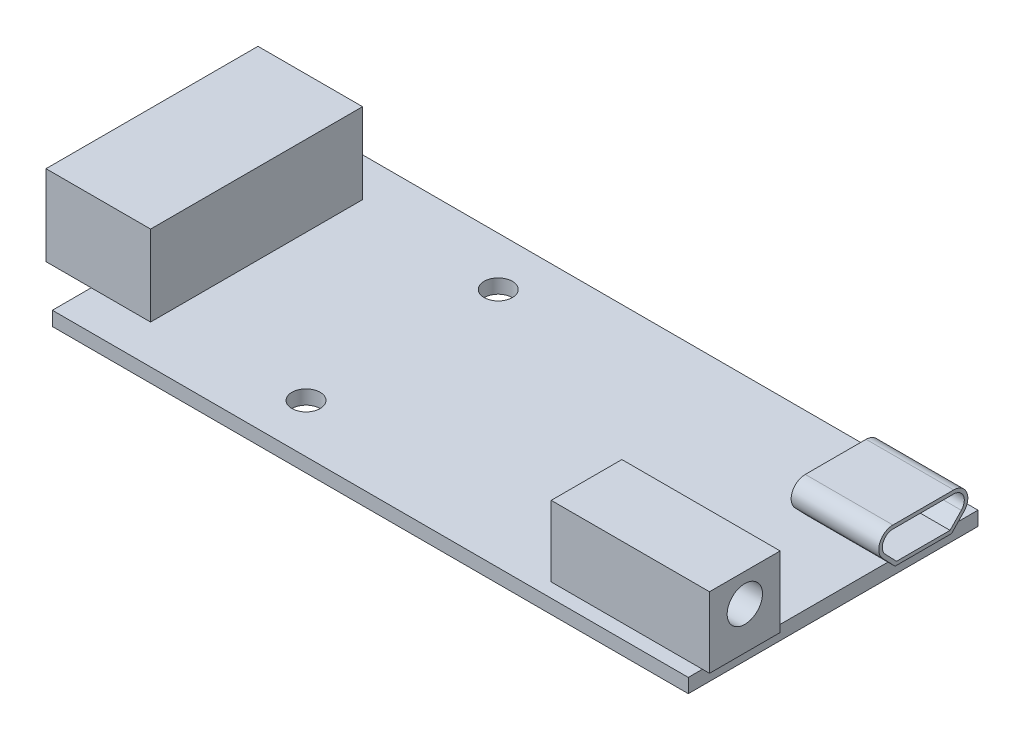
ISO-10303-21;
HEADER;
FILE_DESCRIPTION(('STEP AP214'),'2;1');
FILE_NAME('part.step','',(''),(''),'','','');
FILE_SCHEMA(('AUTOMOTIVE_DESIGN { 1 0 10303 214 1 1 1 1 }'));
ENDSEC;
DATA;
#1=APPLICATION_CONTEXT('core data for automotive mechanical design processes');
#2=APPLICATION_PROTOCOL_DEFINITION('international standard','automotive_design',2000,#1);
#3=PRODUCT_CONTEXT('',#1,'mechanical');
#4=PRODUCT('Part','Part','',(#3));
#5=PRODUCT_RELATED_PRODUCT_CATEGORY('part','',(#4));
#6=PRODUCT_DEFINITION_FORMATION('','',#4);
#7=PRODUCT_DEFINITION_CONTEXT('part definition',#1,'design');
#8=PRODUCT_DEFINITION('design','',#6,#7);
#9=PRODUCT_DEFINITION_SHAPE('','',#8);
#10=(LENGTH_UNIT() NAMED_UNIT(*) SI_UNIT(.MILLI.,.METRE.));
#11=(NAMED_UNIT(*) PLANE_ANGLE_UNIT() SI_UNIT($,.RADIAN.));
#12=(NAMED_UNIT(*) SI_UNIT($,.STERADIAN.) SOLID_ANGLE_UNIT());
#13=UNCERTAINTY_MEASURE_WITH_UNIT(LENGTH_MEASURE(1.E-05),#10,'distance_accuracy_value','');
#14=(GEOMETRIC_REPRESENTATION_CONTEXT(3) GLOBAL_UNCERTAINTY_ASSIGNED_CONTEXT((#13)) GLOBAL_UNIT_ASSIGNED_CONTEXT((#10,
#11,#12)) REPRESENTATION_CONTEXT('',''));
#15=CARTESIAN_POINT('',(0.,0.,0.));
#16=DIRECTION('',(0.,0.,1.));
#17=DIRECTION('',(1.,0.,0.));
#18=AXIS2_PLACEMENT_3D('',#15,#16,#17);
#19=CARTESIAN_POINT('',(0.,1.,0.));
#20=DIRECTION('',(0.,1.,0.));
#21=DIRECTION('',(0.,0.,1.));
#22=AXIS2_PLACEMENT_3D('',#19,#20,#21);
#23=PLANE('',#22);
#24=CARTESIAN_POINT('',(-8.,1.,-6.8));
#25=DIRECTION('',(0.,1.,0.));
#26=DIRECTION('',(0.,0.,1.));
#27=AXIS2_PLACEMENT_3D('',#24,#25,#26);
#28=CIRCLE('',#27,1.);
#29=CARTESIAN_POINT('',(-8.,1.,-5.8));
#30=VERTEX_POINT('',#29);
#31=EDGE_CURVE('E537',#30,#30,#28,.T.);
#32=ORIENTED_EDGE('',*,*,#31,.F.);
#33=EDGE_LOOP('',(#32));
#34=FACE_BOUND('',#33,.T.);
#35=CARTESIAN_POINT('',(-8.,1.,6.8));
#36=DIRECTION('',(0.,1.,0.));
#37=DIRECTION('',(0.,0.,1.));
#38=AXIS2_PLACEMENT_3D('',#35,#36,#37);
#39=CIRCLE('',#38,1.);
#40=CARTESIAN_POINT('',(-8.,1.,7.8));
#41=VERTEX_POINT('',#40);
#42=EDGE_CURVE('E529',#41,#41,#39,.T.);
#43=ORIENTED_EDGE('',*,*,#42,.F.);
#44=EDGE_LOOP('',(#43));
#45=FACE_BOUND('',#44,.T.);
#46=DIRECTION('',(0.,0.,-1.));
#47=VECTOR('',#46,1.);
#48=CARTESIAN_POINT('',(22.5,1.,10.25));
#49=LINE('',#48,#47);
#50=CARTESIAN_POINT('',(22.5,1.,4.25));
#51=VERTEX_POINT('',#50);
#52=CARTESIAN_POINT('',(22.5,1.,-3.87916695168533));
#53=VERTEX_POINT('',#52);
#54=EDGE_CURVE('E614',#51,#53,#49,.T.);
#55=ORIENTED_EDGE('',*,*,#54,.T.);
#56=DIRECTION('',(-1.,0.,0.));
#57=VECTOR('',#56,1.);
#58=CARTESIAN_POINT('',(23.,1.,-3.87916695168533));
#59=LINE('',#58,#57);
#60=CARTESIAN_POINT('',(16.8,1.,-3.87916695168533));
#61=VERTEX_POINT('',#60);
#62=EDGE_CURVE('E66',#53,#61,#59,.T.);
#63=ORIENTED_EDGE('',*,*,#62,.T.);
#64=DIRECTION('',(0.,0.,-1.));
#65=VECTOR('',#64,1.);
#66=CARTESIAN_POINT('',(16.8,1.,-3.87916695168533));
#67=LINE('',#66,#65);
#68=CARTESIAN_POINT('',(16.8,1.,-7.87916695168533));
#69=VERTEX_POINT('',#68);
#70=EDGE_CURVE('E61',#61,#69,#67,.T.);
#71=ORIENTED_EDGE('',*,*,#70,.T.);
#72=DIRECTION('',(-1.,0.,0.));
#73=VECTOR('',#72,1.);
#74=CARTESIAN_POINT('',(23.,1.,-7.87916695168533));
#75=LINE('',#74,#73);
#76=CARTESIAN_POINT('',(22.5,1.,-7.87916695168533));
#77=VERTEX_POINT('',#76);
#78=EDGE_CURVE('E377',#77,#69,#75,.T.);
#79=ORIENTED_EDGE('',*,*,#78,.F.);
#80=CARTESIAN_POINT('',(22.5,1.,-10.25));
#81=VERTEX_POINT('',#80);
#82=EDGE_CURVE('E554',#77,#81,#49,.T.);
#83=ORIENTED_EDGE('',*,*,#82,.T.);
#84=DIRECTION('',(-1.,0.,0.));
#85=VECTOR('',#84,1.);
#86=CARTESIAN_POINT('',(22.5,1.,-10.25));
#87=LINE('',#86,#85);
#88=CARTESIAN_POINT('',(-22.5,1.,-10.25));
#89=VERTEX_POINT('',#88);
#90=EDGE_CURVE('E559',#81,#89,#87,.T.);
#91=ORIENTED_EDGE('',*,*,#90,.T.);
#92=DIRECTION('',(0.,0.,1.));
#93=VECTOR('',#92,1.);
#94=CARTESIAN_POINT('',(-22.5,1.,10.25));
#95=LINE('',#94,#93);
#96=CARTESIAN_POINT('',(-22.5,1.,-7.5));
#97=VERTEX_POINT('',#96);
#98=EDGE_CURVE('E545',#89,#97,#95,.T.);
#99=ORIENTED_EDGE('',*,*,#98,.T.);
#100=DIRECTION('',(-1.,0.,0.));
#101=VECTOR('',#100,1.);
#102=CARTESIAN_POINT('',(-25.7,1.,-7.5));
#103=LINE('',#102,#101);
#104=CARTESIAN_POINT('',(-18.3,1.,-7.5));
#105=VERTEX_POINT('',#104);
#106=EDGE_CURVE('E490',#105,#97,#103,.T.);
#107=ORIENTED_EDGE('',*,*,#106,.F.);
#108=DIRECTION('',(0.,0.,-1.));
#109=VECTOR('',#108,1.);
#110=CARTESIAN_POINT('',(-18.3,1.,-7.5));
#111=LINE('',#110,#109);
#112=CARTESIAN_POINT('',(-18.3,1.,7.5));
#113=VERTEX_POINT('',#112);
#114=EDGE_CURVE('E505',#113,#105,#111,.T.);
#115=ORIENTED_EDGE('',*,*,#114,.F.);
#116=DIRECTION('',(1.,0.,0.));
#117=VECTOR('',#116,1.);
#118=CARTESIAN_POINT('',(-25.7,1.,7.5));
#119=LINE('',#118,#117);
#120=CARTESIAN_POINT('',(-22.5,1.,7.5));
#121=VERTEX_POINT('',#120);
#122=EDGE_CURVE('E11',#121,#113,#119,.T.);
#123=ORIENTED_EDGE('',*,*,#122,.F.);
#124=CARTESIAN_POINT('',(-22.5,1.,10.25));
#125=VERTEX_POINT('',#124);
#126=EDGE_CURVE('E551',#121,#125,#95,.T.);
#127=ORIENTED_EDGE('',*,*,#126,.T.);
#128=DIRECTION('',(1.,0.,0.));
#129=VECTOR('',#128,1.);
#130=CARTESIAN_POINT('',(22.5,1.,10.25));
#131=LINE('',#130,#129);
#132=CARTESIAN_POINT('',(22.5,1.,10.25));
#133=VERTEX_POINT('',#132);
#134=EDGE_CURVE('E549',#125,#133,#131,.T.);
#135=ORIENTED_EDGE('',*,*,#134,.T.);
#136=CARTESIAN_POINT('',(22.5,1.,9.25000000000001));
#137=VERTEX_POINT('',#136);
#138=EDGE_CURVE('E555',#133,#137,#49,.T.);
#139=ORIENTED_EDGE('',*,*,#138,.T.);
#140=DIRECTION('',(1.,0.,0.));
#141=VECTOR('',#140,1.);
#142=CARTESIAN_POINT('',(11.8,1.,9.25000000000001));
#143=LINE('',#142,#141);
#144=CARTESIAN_POINT('',(11.8,1.,9.25000000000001));
#145=VERTEX_POINT('',#144);
#146=EDGE_CURVE('E414',#145,#137,#143,.T.);
#147=ORIENTED_EDGE('',*,*,#146,.F.);
#148=DIRECTION('',(0.,0.,1.));
#149=VECTOR('',#148,1.);
#150=CARTESIAN_POINT('',(11.8,1.,4.25000000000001));
#151=LINE('',#150,#149);
#152=CARTESIAN_POINT('',(11.8,1.,4.25000000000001));
#153=VERTEX_POINT('',#152);
#154=EDGE_CURVE('E391',#153,#145,#151,.T.);
#155=ORIENTED_EDGE('',*,*,#154,.F.);
#156=DIRECTION('',(-1.,0.,0.));
#157=VECTOR('',#156,1.);
#158=CARTESIAN_POINT('',(11.8,1.,4.25000000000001));
#159=LINE('',#158,#157);
#160=EDGE_CURVE('E421',#51,#153,#159,.T.);
#161=ORIENTED_EDGE('',*,*,#160,.F.);
#162=EDGE_LOOP('',(#55,#63,#71,#79,#83,#91,#99,#107,#115,#123,#127,#135,#139,#147,#155,#161));
#163=FACE_BOUND('',#162,.T.);
#164=ADVANCED_FACE('F43',(#34,#45,#163),#23,.T.);
#165=CARTESIAN_POINT('',(0.,0.,0.));
#166=DIRECTION('',(0.,1.,0.));
#167=DIRECTION('',(0.,0.,1.));
#168=AXIS2_PLACEMENT_3D('',#165,#166,#167);
#169=PLANE('',#168);
#170=DIRECTION('',(0.,0.,1.));
#171=VECTOR('',#170,1.);
#172=CARTESIAN_POINT('',(-22.5,0.,10.25));
#173=LINE('',#172,#171);
#174=CARTESIAN_POINT('',(-22.5,0.,-10.25));
#175=VERTEX_POINT('',#174);
#176=CARTESIAN_POINT('',(-22.5,0.,10.25));
#177=VERTEX_POINT('',#176);
#178=EDGE_CURVE('E541',#175,#177,#173,.T.);
#179=ORIENTED_EDGE('',*,*,#178,.F.);
#180=DIRECTION('',(-1.,0.,0.));
#181=VECTOR('',#180,1.);
#182=CARTESIAN_POINT('',(22.5,0.,-10.25));
#183=LINE('',#182,#181);
#184=CARTESIAN_POINT('',(22.5,0.,-10.25));
#185=VERTEX_POINT('',#184);
#186=EDGE_CURVE('E573',#185,#175,#183,.T.);
#187=ORIENTED_EDGE('',*,*,#186,.F.);
#188=DIRECTION('',(0.,0.,-1.));
#189=VECTOR('',#188,1.);
#190=CARTESIAN_POINT('',(22.5,0.,10.25));
#191=LINE('',#190,#189);
#192=CARTESIAN_POINT('',(22.5,0.,10.25));
#193=VERTEX_POINT('',#192);
#194=EDGE_CURVE('E570',#193,#185,#191,.T.);
#195=ORIENTED_EDGE('',*,*,#194,.F.);
#196=DIRECTION('',(1.,0.,0.));
#197=VECTOR('',#196,1.);
#198=CARTESIAN_POINT('',(22.5,0.,10.25));
#199=LINE('',#198,#197);
#200=EDGE_CURVE('E567',#177,#193,#199,.T.);
#201=ORIENTED_EDGE('',*,*,#200,.F.);
#202=EDGE_LOOP('',(#179,#187,#195,#201));
#203=FACE_BOUND('',#202,.T.);
#204=CARTESIAN_POINT('',(-8.,0.,-6.8));
#205=DIRECTION('',(0.,1.,0.));
#206=DIRECTION('',(0.,0.,1.));
#207=AXIS2_PLACEMENT_3D('',#204,#205,#206);
#208=CIRCLE('',#207,1.);
#209=CARTESIAN_POINT('',(-8.,0.,-5.8));
#210=VERTEX_POINT('',#209);
#211=EDGE_CURVE('E533',#210,#210,#208,.T.);
#212=ORIENTED_EDGE('',*,*,#211,.T.);
#213=EDGE_LOOP('',(#212));
#214=FACE_BOUND('',#213,.T.);
#215=CARTESIAN_POINT('',(-8.,0.,6.8));
#216=DIRECTION('',(0.,1.,0.));
#217=DIRECTION('',(0.,0.,1.));
#218=AXIS2_PLACEMENT_3D('',#215,#216,#217);
#219=CIRCLE('',#218,1.);
#220=CARTESIAN_POINT('',(-8.,0.,7.8));
#221=VERTEX_POINT('',#220);
#222=EDGE_CURVE('E528',#221,#221,#219,.T.);
#223=ORIENTED_EDGE('',*,*,#222,.T.);
#224=EDGE_LOOP('',(#223));
#225=FACE_BOUND('',#224,.T.);
#226=ADVANCED_FACE('F602',(#203,#214,#225),#169,.F.);
#227=CARTESIAN_POINT('',(-22.5,1.,10.25));
#228=DIRECTION('',(1.,0.,0.));
#229=DIRECTION('',(0.,0.,-1.));
#230=AXIS2_PLACEMENT_3D('',#227,#228,#229);
#231=PLANE('',#230);
#232=ORIENTED_EDGE('',*,*,#178,.T.);
#233=DIRECTION('',(0.,-1.,0.));
#234=VECTOR('',#233,1.);
#235=CARTESIAN_POINT('',(-22.5,1.,10.25));
#236=LINE('',#235,#234);
#237=EDGE_CURVE('E47',#125,#177,#236,.T.);
#238=ORIENTED_EDGE('',*,*,#237,.F.);
#239=ORIENTED_EDGE('',*,*,#126,.F.);
#240=EDGE_CURVE('E550',#97,#121,#95,.T.);
#241=ORIENTED_EDGE('',*,*,#240,.F.);
#242=ORIENTED_EDGE('',*,*,#98,.F.);
#243=DIRECTION('',(0.,-1.,0.));
#244=VECTOR('',#243,1.);
#245=CARTESIAN_POINT('',(-22.5,1.,-10.25));
#246=LINE('',#245,#244);
#247=EDGE_CURVE('E563',#89,#175,#246,.T.);
#248=ORIENTED_EDGE('',*,*,#247,.T.);
#249=EDGE_LOOP('',(#232,#238,#239,#241,#242,#248));
#250=FACE_BOUND('',#249,.T.);
#251=ADVANCED_FACE('F45',(#250),#231,.F.);
#252=CARTESIAN_POINT('',(22.5,1.,10.25));
#253=DIRECTION('',(0.,0.,-1.));
#254=DIRECTION('',(-1.,0.,0.));
#255=AXIS2_PLACEMENT_3D('',#252,#253,#254);
#256=PLANE('',#255);
#257=ORIENTED_EDGE('',*,*,#200,.T.);
#258=DIRECTION('',(0.,-1.,0.));
#259=VECTOR('',#258,1.);
#260=CARTESIAN_POINT('',(22.5,1.,10.25));
#261=LINE('',#260,#259);
#262=EDGE_CURVE('E582',#133,#193,#261,.T.);
#263=ORIENTED_EDGE('',*,*,#262,.F.);
#264=ORIENTED_EDGE('',*,*,#134,.F.);
#265=ORIENTED_EDGE('',*,*,#237,.T.);
#266=EDGE_LOOP('',(#257,#263,#264,#265));
#267=FACE_BOUND('',#266,.T.);
#268=ADVANCED_FACE('F594',(#267),#256,.F.);
#269=CARTESIAN_POINT('',(22.5,1.,10.25));
#270=DIRECTION('',(-1.,0.,0.));
#271=DIRECTION('',(0.,0.,1.));
#272=AXIS2_PLACEMENT_3D('',#269,#270,#271);
#273=PLANE('',#272);
#274=ORIENTED_EDGE('',*,*,#194,.T.);
#275=DIRECTION('',(0.,-1.,0.));
#276=VECTOR('',#275,1.);
#277=CARTESIAN_POINT('',(22.5,1.,-10.25));
#278=LINE('',#277,#276);
#279=EDGE_CURVE('E579',#81,#185,#278,.T.);
#280=ORIENTED_EDGE('',*,*,#279,.F.);
#281=ORIENTED_EDGE('',*,*,#82,.F.);
#282=EDGE_CURVE('E612',#53,#77,#49,.T.);
#283=ORIENTED_EDGE('',*,*,#282,.F.);
#284=ORIENTED_EDGE('',*,*,#54,.F.);
#285=EDGE_CURVE('E560',#137,#51,#49,.T.);
#286=ORIENTED_EDGE('',*,*,#285,.F.);
#287=ORIENTED_EDGE('',*,*,#138,.F.);
#288=ORIENTED_EDGE('',*,*,#262,.T.);
#289=EDGE_LOOP('',(#274,#280,#281,#283,#284,#286,#287,#288));
#290=FACE_BOUND('',#289,.T.);
#291=ADVANCED_FACE('F605',(#290),#273,.F.);
#292=CARTESIAN_POINT('',(22.5,1.,-10.25));
#293=DIRECTION('',(0.,0.,1.));
#294=DIRECTION('',(1.,0.,0.));
#295=AXIS2_PLACEMENT_3D('',#292,#293,#294);
#296=PLANE('',#295);
#297=ORIENTED_EDGE('',*,*,#186,.T.);
#298=ORIENTED_EDGE('',*,*,#247,.F.);
#299=ORIENTED_EDGE('',*,*,#90,.F.);
#300=ORIENTED_EDGE('',*,*,#279,.T.);
#301=EDGE_LOOP('',(#297,#298,#299,#300));
#302=FACE_BOUND('',#301,.T.);
#303=ADVANCED_FACE('F608',(#302),#296,.F.);
#304=CARTESIAN_POINT('',(-8.,1.,-6.8));
#305=DIRECTION('',(0.,-1.,0.));
#306=DIRECTION('',(0.,0.,-1.));
#307=AXIS2_PLACEMENT_3D('',#304,#305,#306);
#308=CYLINDRICAL_SURFACE('',#307,1.);
#309=ORIENTED_EDGE('',*,*,#31,.T.);
#310=EDGE_LOOP('',(#309));
#311=FACE_BOUND('',#310,.T.);
#312=ORIENTED_EDGE('',*,*,#211,.F.);
#313=EDGE_LOOP('',(#312));
#314=FACE_BOUND('',#313,.T.);
#315=ADVANCED_FACE('F685',(#311,#314),#308,.F.);
#316=CARTESIAN_POINT('',(-8.,1.,6.8));
#317=DIRECTION('',(0.,-1.,0.));
#318=DIRECTION('',(0.,0.,-1.));
#319=AXIS2_PLACEMENT_3D('',#316,#317,#318);
#320=CYLINDRICAL_SURFACE('',#319,1.);
#321=ORIENTED_EDGE('',*,*,#42,.T.);
#322=EDGE_LOOP('',(#321));
#323=FACE_BOUND('',#322,.T.);
#324=ORIENTED_EDGE('',*,*,#222,.F.);
#325=EDGE_LOOP('',(#324));
#326=FACE_BOUND('',#325,.T.);
#327=ADVANCED_FACE('F725',(#323,#326),#320,.F.);
#328=CARTESIAN_POINT('',(0.,1.,0.));
#329=DIRECTION('',(0.,1.,0.));
#330=DIRECTION('',(0.,0.,1.));
#331=AXIS2_PLACEMENT_3D('',#328,#329,#330);
#332=PLANE('',#331);
#333=CARTESIAN_POINT('',(-25.7,1.,-7.5));
#334=VERTEX_POINT('',#333);
#335=EDGE_CURVE('E509',#97,#334,#103,.T.);
#336=ORIENTED_EDGE('',*,*,#335,.F.);
#337=ORIENTED_EDGE('',*,*,#240,.T.);
#338=CARTESIAN_POINT('',(-25.7,1.,7.5));
#339=VERTEX_POINT('',#338);
#340=EDGE_CURVE('E54',#339,#121,#119,.T.);
#341=ORIENTED_EDGE('',*,*,#340,.F.);
#342=DIRECTION('',(0.,0.,1.));
#343=VECTOR('',#342,1.);
#344=CARTESIAN_POINT('',(-25.7,1.,-7.5));
#345=LINE('',#344,#343);
#346=EDGE_CURVE('E475',#334,#339,#345,.T.);
#347=ORIENTED_EDGE('',*,*,#346,.F.);
#348=EDGE_LOOP('',(#336,#337,#341,#347));
#349=FACE_BOUND('',#348,.T.);
#350=ADVANCED_FACE('F734',(#349),#332,.F.);
#351=CARTESIAN_POINT('',(-25.7,6.7,-7.5));
#352=DIRECTION('',(1.,0.,0.));
#353=DIRECTION('',(0.,0.,-1.));
#354=AXIS2_PLACEMENT_3D('',#351,#352,#353);
#355=PLANE('',#354);
#356=DIRECTION('',(0.,0.,1.));
#357=VECTOR('',#356,1.);
#358=CARTESIAN_POINT('',(-25.7,1.7,-6.8));
#359=LINE('',#358,#357);
#360=CARTESIAN_POINT('',(-25.7,1.7,-6.8));
#361=VERTEX_POINT('',#360);
#362=CARTESIAN_POINT('',(-25.7,1.7,6.8));
#363=VERTEX_POINT('',#362);
#364=EDGE_CURVE('E461',#361,#363,#359,.T.);
#365=ORIENTED_EDGE('',*,*,#364,.F.);
#366=DIRECTION('',(0.,-1.,0.));
#367=VECTOR('',#366,1.);
#368=CARTESIAN_POINT('',(-25.7,6.,-6.8));
#369=LINE('',#368,#367);
#370=CARTESIAN_POINT('',(-25.7,6.,-6.8));
#371=VERTEX_POINT('',#370);
#372=EDGE_CURVE('E440',#371,#361,#369,.T.);
#373=ORIENTED_EDGE('',*,*,#372,.F.);
#374=DIRECTION('',(0.,0.,-1.));
#375=VECTOR('',#374,1.);
#376=CARTESIAN_POINT('',(-25.7,6.,-6.8));
#377=LINE('',#376,#375);
#378=CARTESIAN_POINT('',(-25.7,6.,6.8));
#379=VERTEX_POINT('',#378);
#380=EDGE_CURVE('E446',#379,#371,#377,.T.);
#381=ORIENTED_EDGE('',*,*,#380,.F.);
#382=DIRECTION('',(0.,1.,0.));
#383=VECTOR('',#382,1.);
#384=CARTESIAN_POINT('',(-25.7,6.,6.8));
#385=LINE('',#384,#383);
#386=EDGE_CURVE('E465',#363,#379,#385,.T.);
#387=ORIENTED_EDGE('',*,*,#386,.F.);
#388=EDGE_LOOP('',(#365,#373,#381,#387));
#389=FACE_BOUND('',#388,.T.);
#390=ORIENTED_EDGE('',*,*,#346,.T.);
#391=DIRECTION('',(0.,-1.,0.));
#392=VECTOR('',#391,1.);
#393=CARTESIAN_POINT('',(-25.7,6.7,7.5));
#394=LINE('',#393,#392);
#395=CARTESIAN_POINT('',(-25.7,6.7,7.5));
#396=VERTEX_POINT('',#395);
#397=EDGE_CURVE('E524',#396,#339,#394,.T.);
#398=ORIENTED_EDGE('',*,*,#397,.F.);
#399=DIRECTION('',(0.,0.,1.));
#400=VECTOR('',#399,1.);
#401=CARTESIAN_POINT('',(-25.7,6.7,-7.5));
#402=LINE('',#401,#400);
#403=CARTESIAN_POINT('',(-25.7,6.7,-7.5));
#404=VERTEX_POINT('',#403);
#405=EDGE_CURVE('E485',#404,#396,#402,.T.);
#406=ORIENTED_EDGE('',*,*,#405,.F.);
#407=DIRECTION('',(0.,-1.,0.));
#408=VECTOR('',#407,1.);
#409=CARTESIAN_POINT('',(-25.7,6.7,-7.5));
#410=LINE('',#409,#408);
#411=EDGE_CURVE('E499',#404,#334,#410,.T.);
#412=ORIENTED_EDGE('',*,*,#411,.T.);
#413=EDGE_LOOP('',(#390,#398,#406,#412));
#414=FACE_BOUND('',#413,.T.);
#415=ADVANCED_FACE('F744',(#389,#414),#355,.F.);
#416=CARTESIAN_POINT('',(-25.7,6.7,7.5));
#417=DIRECTION('',(0.,0.,-1.));
#418=DIRECTION('',(-1.,0.,0.));
#419=AXIS2_PLACEMENT_3D('',#416,#417,#418);
#420=PLANE('',#419);
#421=ORIENTED_EDGE('',*,*,#340,.T.);
#422=ORIENTED_EDGE('',*,*,#122,.T.);
#423=DIRECTION('',(0.,-1.,0.));
#424=VECTOR('',#423,1.);
#425=CARTESIAN_POINT('',(-18.3,6.7,7.5));
#426=LINE('',#425,#424);
#427=CARTESIAN_POINT('',(-18.3,6.7,7.5));
#428=VERTEX_POINT('',#427);
#429=EDGE_CURVE('E520',#428,#113,#426,.T.);
#430=ORIENTED_EDGE('',*,*,#429,.F.);
#431=DIRECTION('',(1.,0.,0.));
#432=VECTOR('',#431,1.);
#433=CARTESIAN_POINT('',(-25.7,6.7,7.5));
#434=LINE('',#433,#432);
#435=EDGE_CURVE('E489',#396,#428,#434,.T.);
#436=ORIENTED_EDGE('',*,*,#435,.F.);
#437=ORIENTED_EDGE('',*,*,#397,.T.);
#438=EDGE_LOOP('',(#421,#422,#430,#436,#437));
#439=FACE_BOUND('',#438,.T.);
#440=ADVANCED_FACE('F752',(#439),#420,.F.);
#441=CARTESIAN_POINT('',(-18.3,6.7,-7.5));
#442=DIRECTION('',(-1.,0.,0.));
#443=DIRECTION('',(0.,0.,1.));
#444=AXIS2_PLACEMENT_3D('',#441,#442,#443);
#445=PLANE('',#444);
#446=ORIENTED_EDGE('',*,*,#114,.T.);
#447=DIRECTION('',(0.,-1.,0.));
#448=VECTOR('',#447,1.);
#449=CARTESIAN_POINT('',(-18.3,6.7,-7.5));
#450=LINE('',#449,#448);
#451=CARTESIAN_POINT('',(-18.3,6.7,-7.5));
#452=VERTEX_POINT('',#451);
#453=EDGE_CURVE('E516',#452,#105,#450,.T.);
#454=ORIENTED_EDGE('',*,*,#453,.F.);
#455=DIRECTION('',(0.,0.,-1.));
#456=VECTOR('',#455,1.);
#457=CARTESIAN_POINT('',(-18.3,6.7,-7.5));
#458=LINE('',#457,#456);
#459=EDGE_CURVE('E493',#428,#452,#458,.T.);
#460=ORIENTED_EDGE('',*,*,#459,.F.);
#461=ORIENTED_EDGE('',*,*,#429,.T.);
#462=EDGE_LOOP('',(#446,#454,#460,#461));
#463=FACE_BOUND('',#462,.T.);
#464=ADVANCED_FACE('F761',(#463),#445,.F.);
#465=CARTESIAN_POINT('',(-25.7,6.7,-7.5));
#466=DIRECTION('',(0.,0.,1.));
#467=DIRECTION('',(1.,0.,0.));
#468=AXIS2_PLACEMENT_3D('',#465,#466,#467);
#469=PLANE('',#468);
#470=ORIENTED_EDGE('',*,*,#106,.T.);
#471=ORIENTED_EDGE('',*,*,#335,.T.);
#472=ORIENTED_EDGE('',*,*,#411,.F.);
#473=DIRECTION('',(-1.,0.,0.));
#474=VECTOR('',#473,1.);
#475=CARTESIAN_POINT('',(-25.7,6.7,-7.5));
#476=LINE('',#475,#474);
#477=EDGE_CURVE('E496',#452,#404,#476,.T.);
#478=ORIENTED_EDGE('',*,*,#477,.F.);
#479=ORIENTED_EDGE('',*,*,#453,.T.);
#480=EDGE_LOOP('',(#470,#471,#472,#478,#479));
#481=FACE_BOUND('',#480,.T.);
#482=ADVANCED_FACE('F769',(#481),#469,.F.);
#483=CARTESIAN_POINT('',(0.,6.7,0.));
#484=DIRECTION('',(0.,1.,0.));
#485=DIRECTION('',(0.,0.,1.));
#486=AXIS2_PLACEMENT_3D('',#483,#484,#485);
#487=PLANE('',#486);
#488=ORIENTED_EDGE('',*,*,#405,.T.);
#489=ORIENTED_EDGE('',*,*,#435,.T.);
#490=ORIENTED_EDGE('',*,*,#459,.T.);
#491=ORIENTED_EDGE('',*,*,#477,.T.);
#492=EDGE_LOOP('',(#488,#489,#490,#491));
#493=FACE_BOUND('',#492,.T.);
#494=ADVANCED_FACE('F777',(#493),#487,.T.);
#495=CARTESIAN_POINT('',(-19.7,6.,-6.8));
#496=DIRECTION('',(0.,0.,-1.));
#497=DIRECTION('',(-1.,0.,0.));
#498=AXIS2_PLACEMENT_3D('',#495,#496,#497);
#499=PLANE('',#498);
#500=ORIENTED_EDGE('',*,*,#372,.T.);
#501=DIRECTION('',(-1.,0.,0.));
#502=VECTOR('',#501,1.);
#503=CARTESIAN_POINT('',(-19.7,1.7,-6.8));
#504=LINE('',#503,#502);
#505=CARTESIAN_POINT('',(-19.7,1.7,-6.8));
#506=VERTEX_POINT('',#505);
#507=EDGE_CURVE('E458',#506,#361,#504,.T.);
#508=ORIENTED_EDGE('',*,*,#507,.F.);
#509=DIRECTION('',(0.,-1.,0.));
#510=VECTOR('',#509,1.);
#511=CARTESIAN_POINT('',(-19.7,6.,-6.8));
#512=LINE('',#511,#510);
#513=CARTESIAN_POINT('',(-19.7,6.,-6.8));
#514=VERTEX_POINT('',#513);
#515=EDGE_CURVE('E441',#514,#506,#512,.T.);
#516=ORIENTED_EDGE('',*,*,#515,.F.);
#517=DIRECTION('',(-1.,0.,0.));
#518=VECTOR('',#517,1.);
#519=CARTESIAN_POINT('',(-19.7,6.,-6.8));
#520=LINE('',#519,#518);
#521=EDGE_CURVE('E472',#514,#371,#520,.T.);
#522=ORIENTED_EDGE('',*,*,#521,.T.);
#523=EDGE_LOOP('',(#500,#508,#516,#522));
#524=FACE_BOUND('',#523,.T.);
#525=ADVANCED_FACE('F784',(#524),#499,.F.);
#526=CARTESIAN_POINT('',(-19.7,6.,-6.8));
#527=DIRECTION('',(0.,1.,0.));
#528=DIRECTION('',(0.,0.,1.));
#529=AXIS2_PLACEMENT_3D('',#526,#527,#528);
#530=PLANE('',#529);
#531=ORIENTED_EDGE('',*,*,#380,.T.);
#532=ORIENTED_EDGE('',*,*,#521,.F.);
#533=DIRECTION('',(0.,0.,-1.));
#534=VECTOR('',#533,1.);
#535=CARTESIAN_POINT('',(-19.7,6.,-6.8));
#536=LINE('',#535,#534);
#537=CARTESIAN_POINT('',(-19.7,6.,6.8));
#538=VERTEX_POINT('',#537);
#539=EDGE_CURVE('E454',#538,#514,#536,.T.);
#540=ORIENTED_EDGE('',*,*,#539,.F.);
#541=DIRECTION('',(-1.,0.,0.));
#542=VECTOR('',#541,1.);
#543=CARTESIAN_POINT('',(-19.7,6.,6.8));
#544=LINE('',#543,#542);
#545=EDGE_CURVE('E476',#538,#379,#544,.T.);
#546=ORIENTED_EDGE('',*,*,#545,.T.);
#547=EDGE_LOOP('',(#531,#532,#540,#546));
#548=FACE_BOUND('',#547,.T.);
#549=ADVANCED_FACE('F791',(#548),#530,.F.);
#550=CARTESIAN_POINT('',(-19.7,6.,6.8));
#551=DIRECTION('',(0.,0.,1.));
#552=DIRECTION('',(1.,0.,0.));
#553=AXIS2_PLACEMENT_3D('',#550,#551,#552);
#554=PLANE('',#553);
#555=ORIENTED_EDGE('',*,*,#386,.T.);
#556=ORIENTED_EDGE('',*,*,#545,.F.);
#557=DIRECTION('',(0.,1.,0.));
#558=VECTOR('',#557,1.);
#559=CARTESIAN_POINT('',(-19.7,6.,6.8));
#560=LINE('',#559,#558);
#561=CARTESIAN_POINT('',(-19.7,1.7,6.8));
#562=VERTEX_POINT('',#561);
#563=EDGE_CURVE('E450',#562,#538,#560,.T.);
#564=ORIENTED_EDGE('',*,*,#563,.F.);
#565=DIRECTION('',(-1.,0.,0.));
#566=VECTOR('',#565,1.);
#567=CARTESIAN_POINT('',(-19.7,1.7,6.8));
#568=LINE('',#567,#566);
#569=EDGE_CURVE('E479',#562,#363,#568,.T.);
#570=ORIENTED_EDGE('',*,*,#569,.T.);
#571=EDGE_LOOP('',(#555,#556,#564,#570));
#572=FACE_BOUND('',#571,.T.);
#573=ADVANCED_FACE('F799',(#572),#554,.F.);
#574=CARTESIAN_POINT('',(-19.7,1.7,-6.8));
#575=DIRECTION('',(0.,-1.,0.));
#576=DIRECTION('',(0.,0.,-1.));
#577=AXIS2_PLACEMENT_3D('',#574,#575,#576);
#578=PLANE('',#577);
#579=ORIENTED_EDGE('',*,*,#364,.T.);
#580=ORIENTED_EDGE('',*,*,#569,.F.);
#581=DIRECTION('',(0.,0.,1.));
#582=VECTOR('',#581,1.);
#583=CARTESIAN_POINT('',(-19.7,1.7,-6.8));
#584=LINE('',#583,#582);
#585=EDGE_CURVE('E445',#506,#562,#584,.T.);
#586=ORIENTED_EDGE('',*,*,#585,.F.);
#587=ORIENTED_EDGE('',*,*,#507,.T.);
#588=EDGE_LOOP('',(#579,#580,#586,#587));
#589=FACE_BOUND('',#588,.T.);
#590=ADVANCED_FACE('F807',(#589),#578,.F.);
#591=CARTESIAN_POINT('',(-19.7,0.,0.));
#592=DIRECTION('',(-1.,0.,0.));
#593=DIRECTION('',(0.,0.,1.));
#594=AXIS2_PLACEMENT_3D('',#591,#592,#593);
#595=PLANE('',#594);
#596=ORIENTED_EDGE('',*,*,#515,.T.);
#597=ORIENTED_EDGE('',*,*,#585,.T.);
#598=ORIENTED_EDGE('',*,*,#563,.T.);
#599=ORIENTED_EDGE('',*,*,#539,.T.);
#600=EDGE_LOOP('',(#596,#597,#598,#599));
#601=FACE_BOUND('',#600,.T.);
#602=ADVANCED_FACE('F815',(#601),#595,.T.);
#603=CARTESIAN_POINT('',(0.,1.,0.));
#604=DIRECTION('',(0.,1.,0.));
#605=DIRECTION('',(0.,0.,1.));
#606=AXIS2_PLACEMENT_3D('',#603,#604,#605);
#607=PLANE('',#606);
#608=CARTESIAN_POINT('',(23.,1.,9.25000000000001));
#609=VERTEX_POINT('',#608);
#610=EDGE_CURVE('E413',#137,#609,#143,.T.);
#611=ORIENTED_EDGE('',*,*,#610,.F.);
#612=ORIENTED_EDGE('',*,*,#285,.T.);
#613=CARTESIAN_POINT('',(23.,1.,4.25));
#614=VERTEX_POINT('',#613);
#615=EDGE_CURVE('E400',#614,#51,#159,.T.);
#616=ORIENTED_EDGE('',*,*,#615,.F.);
#617=DIRECTION('',(0.,0.,-1.));
#618=VECTOR('',#617,1.);
#619=CARTESIAN_POINT('',(23.,1.,4.25));
#620=LINE('',#619,#618);
#621=EDGE_CURVE('E418',#609,#614,#620,.T.);
#622=ORIENTED_EDGE('',*,*,#621,.F.);
#623=EDGE_LOOP('',(#611,#612,#616,#622));
#624=FACE_BOUND('',#623,.T.);
#625=ADVANCED_FACE('F624',(#624),#607,.F.);
#626=CARTESIAN_POINT('',(11.8,6.,4.25000000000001));
#627=DIRECTION('',(1.,0.,0.));
#628=DIRECTION('',(0.,0.,-1.));
#629=AXIS2_PLACEMENT_3D('',#626,#627,#628);
#630=PLANE('',#629);
#631=ORIENTED_EDGE('',*,*,#154,.T.);
#632=DIRECTION('',(0.,-1.,0.));
#633=VECTOR('',#632,1.);
#634=CARTESIAN_POINT('',(11.8,6.,9.25000000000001));
#635=LINE('',#634,#633);
#636=CARTESIAN_POINT('',(11.8,6.,9.25000000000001));
#637=VERTEX_POINT('',#636);
#638=EDGE_CURVE('E436',#637,#145,#635,.T.);
#639=ORIENTED_EDGE('',*,*,#638,.F.);
#640=DIRECTION('',(0.,0.,1.));
#641=VECTOR('',#640,1.);
#642=CARTESIAN_POINT('',(11.8,6.,4.25000000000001));
#643=LINE('',#642,#641);
#644=CARTESIAN_POINT('',(11.8,6.,4.25000000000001));
#645=VERTEX_POINT('',#644);
#646=EDGE_CURVE('E395',#645,#637,#643,.T.);
#647=ORIENTED_EDGE('',*,*,#646,.F.);
#648=DIRECTION('',(0.,-1.,0.));
#649=VECTOR('',#648,1.);
#650=CARTESIAN_POINT('',(11.8,6.,4.25000000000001));
#651=LINE('',#650,#649);
#652=EDGE_CURVE('E409',#645,#153,#651,.T.);
#653=ORIENTED_EDGE('',*,*,#652,.T.);
#654=EDGE_LOOP('',(#631,#639,#647,#653));
#655=FACE_BOUND('',#654,.T.);
#656=ADVANCED_FACE('F830',(#655),#630,.F.);
#657=CARTESIAN_POINT('',(11.8,6.,9.25000000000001));
#658=DIRECTION('',(0.,0.,-1.));
#659=DIRECTION('',(-1.,0.,0.));
#660=AXIS2_PLACEMENT_3D('',#657,#658,#659);
#661=PLANE('',#660);
#662=ORIENTED_EDGE('',*,*,#146,.T.);
#663=ORIENTED_EDGE('',*,*,#610,.T.);
#664=DIRECTION('',(0.,-1.,0.));
#665=VECTOR('',#664,1.);
#666=CARTESIAN_POINT('',(23.,6.,9.25000000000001));
#667=LINE('',#666,#665);
#668=CARTESIAN_POINT('',(23.,6.,9.25000000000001));
#669=VERTEX_POINT('',#668);
#670=EDGE_CURVE('E432',#669,#609,#667,.T.);
#671=ORIENTED_EDGE('',*,*,#670,.F.);
#672=DIRECTION('',(1.,0.,0.));
#673=VECTOR('',#672,1.);
#674=CARTESIAN_POINT('',(11.8,6.,9.25000000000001));
#675=LINE('',#674,#673);
#676=EDGE_CURVE('E399',#637,#669,#675,.T.);
#677=ORIENTED_EDGE('',*,*,#676,.F.);
#678=ORIENTED_EDGE('',*,*,#638,.T.);
#679=EDGE_LOOP('',(#662,#663,#671,#677,#678));
#680=FACE_BOUND('',#679,.T.);
#681=ADVANCED_FACE('F637',(#680),#661,.F.);
#682=CARTESIAN_POINT('',(23.,6.,4.25));
#683=DIRECTION('',(-1.,0.,0.));
#684=DIRECTION('',(0.,0.,1.));
#685=AXIS2_PLACEMENT_3D('',#682,#683,#684);
#686=PLANE('',#685);
#687=CARTESIAN_POINT('',(23.,4.,6.75));
#688=DIRECTION('',(1.,0.,0.));
#689=DIRECTION('',(0.,0.,-1.));
#690=AXIS2_PLACEMENT_3D('',#687,#688,#689);
#691=CIRCLE('',#690,1.25);
#692=CARTESIAN_POINT('',(23.,4.,5.5));
#693=VERTEX_POINT('',#692);
#694=EDGE_CURVE('E386',#693,#693,#691,.T.);
#695=ORIENTED_EDGE('',*,*,#694,.F.);
#696=EDGE_LOOP('',(#695));
#697=FACE_BOUND('',#696,.T.);
#698=ORIENTED_EDGE('',*,*,#621,.T.);
#699=DIRECTION('',(0.,-1.,0.));
#700=VECTOR('',#699,1.);
#701=CARTESIAN_POINT('',(23.,6.,4.25));
#702=LINE('',#701,#700);
#703=CARTESIAN_POINT('',(23.,6.,4.25));
#704=VERTEX_POINT('',#703);
#705=EDGE_CURVE('E428',#704,#614,#702,.T.);
#706=ORIENTED_EDGE('',*,*,#705,.F.);
#707=DIRECTION('',(0.,0.,-1.));
#708=VECTOR('',#707,1.);
#709=CARTESIAN_POINT('',(23.,6.,4.25));
#710=LINE('',#709,#708);
#711=EDGE_CURVE('E403',#669,#704,#710,.T.);
#712=ORIENTED_EDGE('',*,*,#711,.F.);
#713=ORIENTED_EDGE('',*,*,#670,.T.);
#714=EDGE_LOOP('',(#698,#706,#712,#713));
#715=FACE_BOUND('',#714,.T.);
#716=ADVANCED_FACE('F634',(#697,#715),#686,.F.);
#717=CARTESIAN_POINT('',(11.8,6.,4.25000000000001));
#718=DIRECTION('',(0.,0.,1.));
#719=DIRECTION('',(1.,0.,0.));
#720=AXIS2_PLACEMENT_3D('',#717,#718,#719);
#721=PLANE('',#720);
#722=ORIENTED_EDGE('',*,*,#615,.T.);
#723=ORIENTED_EDGE('',*,*,#160,.T.);
#724=ORIENTED_EDGE('',*,*,#652,.F.);
#725=DIRECTION('',(-1.,0.,0.));
#726=VECTOR('',#725,1.);
#727=CARTESIAN_POINT('',(11.8,6.,4.25000000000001));
#728=LINE('',#727,#726);
#729=EDGE_CURVE('E406',#704,#645,#728,.T.);
#730=ORIENTED_EDGE('',*,*,#729,.F.);
#731=ORIENTED_EDGE('',*,*,#705,.T.);
#732=EDGE_LOOP('',(#722,#723,#724,#730,#731));
#733=FACE_BOUND('',#732,.T.);
#734=ADVANCED_FACE('F628',(#733),#721,.F.);
#735=CARTESIAN_POINT('',(0.,6.,0.));
#736=DIRECTION('',(0.,1.,0.));
#737=DIRECTION('',(0.,0.,1.));
#738=AXIS2_PLACEMENT_3D('',#735,#736,#737);
#739=PLANE('',#738);
#740=ORIENTED_EDGE('',*,*,#646,.T.);
#741=ORIENTED_EDGE('',*,*,#676,.T.);
#742=ORIENTED_EDGE('',*,*,#711,.T.);
#743=ORIENTED_EDGE('',*,*,#729,.T.);
#744=EDGE_LOOP('',(#740,#741,#742,#743));
#745=FACE_BOUND('',#744,.T.);
#746=ADVANCED_FACE('F859',(#745),#739,.T.);
#747=CARTESIAN_POINT('',(15.,4.,6.75));
#748=DIRECTION('',(1.,0.,0.));
#749=DIRECTION('',(0.,0.,-1.));
#750=AXIS2_PLACEMENT_3D('',#747,#748,#749);
#751=CYLINDRICAL_SURFACE('',#750,1.25);
#752=CARTESIAN_POINT('',(15.,4.,6.75));
#753=DIRECTION('',(1.,0.,0.));
#754=DIRECTION('',(0.,0.,-1.));
#755=AXIS2_PLACEMENT_3D('',#752,#753,#754);
#756=CIRCLE('',#755,1.25);
#757=CARTESIAN_POINT('',(15.,4.,5.5));
#758=VERTEX_POINT('',#757);
#759=EDGE_CURVE('E387',#758,#758,#756,.T.);
#760=ORIENTED_EDGE('',*,*,#759,.F.);
#761=EDGE_LOOP('',(#760));
#762=FACE_BOUND('',#761,.T.);
#763=ORIENTED_EDGE('',*,*,#694,.T.);
#764=EDGE_LOOP('',(#763));
#765=FACE_BOUND('',#764,.T.);
#766=ADVANCED_FACE('F670',(#762,#765),#751,.F.);
#767=CARTESIAN_POINT('',(15.,4.,6.75));
#768=DIRECTION('',(1.,0.,0.));
#769=DIRECTION('',(0.,0.,-1.));
#770=AXIS2_PLACEMENT_3D('',#767,#768,#769);
#771=PLANE('',#770);
#772=ORIENTED_EDGE('',*,*,#759,.T.);
#773=EDGE_LOOP('',(#772));
#774=FACE_BOUND('',#773,.T.);
#775=ADVANCED_FACE('F662',(#774),#771,.T.);
#776=CARTESIAN_POINT('',(23.,1.,-3.87916695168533));
#777=DIRECTION('',(0.,1.,0.));
#778=DIRECTION('',(0.,0.,1.));
#779=AXIS2_PLACEMENT_3D('',#776,#777,#778);
#780=PLANE('',#779);
#781=CARTESIAN_POINT('',(23.,1.,-3.87916695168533));
#782=VERTEX_POINT('',#781);
#783=EDGE_CURVE('E382',#782,#53,#59,.T.);
#784=ORIENTED_EDGE('',*,*,#783,.T.);
#785=ORIENTED_EDGE('',*,*,#282,.T.);
#786=CARTESIAN_POINT('',(23.,1.,-7.87916695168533));
#787=VERTEX_POINT('',#786);
#788=EDGE_CURVE('E378',#787,#77,#75,.T.);
#789=ORIENTED_EDGE('',*,*,#788,.F.);
#790=DIRECTION('',(0.,0.,-1.));
#791=VECTOR('',#790,1.);
#792=CARTESIAN_POINT('',(23.,1.,-3.87916695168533));
#793=LINE('',#792,#791);
#794=EDGE_CURVE('E350',#782,#787,#793,.T.);
#795=ORIENTED_EDGE('',*,*,#794,.F.);
#796=EDGE_LOOP('',(#784,#785,#789,#795));
#797=FACE_BOUND('',#796,.T.);
#798=ADVANCED_FACE('F660',(#797),#780,.F.);
#799=CARTESIAN_POINT('',(23.,2.6,-8.03034473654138));
#800=DIRECTION('',(1.,0.,0.));
#801=DIRECTION('',(0.,0.,-1.));
#802=AXIS2_PLACEMENT_3D('',#799,#800,#801);
#803=PLANE('',#802);
#804=DIRECTION('',(0.,-0.720833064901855,-0.693108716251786));
#805=VECTOR('',#804,1.);
#806=CARTESIAN_POINT('',(23.,1.90689128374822,-3.00715610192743));
#807=LINE('',#806,#805);
#808=CARTESIAN_POINT('',(23.,1.90689128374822,-3.00715610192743));
#809=VERTEX_POINT('',#808);
#810=EDGE_CURVE('E261',#809,#782,#807,.T.);
#811=ORIENTED_EDGE('',*,*,#810,.T.);
#812=ORIENTED_EDGE('',*,*,#794,.T.);
#813=DIRECTION('',(0.,0.720833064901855,-0.693108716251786));
#814=VECTOR('',#813,1.);
#815=CARTESIAN_POINT('',(23.,1.,-7.87916695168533));
#816=LINE('',#815,#814);
#817=CARTESIAN_POINT('',(23.,1.90689128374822,-8.75117780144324));
#818=VERTEX_POINT('',#817);
#819=EDGE_CURVE('E353',#787,#818,#816,.T.);
#820=ORIENTED_EDGE('',*,*,#819,.T.);
#821=CARTESIAN_POINT('',(23.,2.6,-8.03034473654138));
#822=DIRECTION('',(1.,0.,0.));
#823=DIRECTION('',(0.,0.,-1.));
#824=AXIS2_PLACEMENT_3D('',#821,#822,#823);
#825=CIRCLE('',#824,1.);
#826=CARTESIAN_POINT('',(23.,3.6,-8.03034473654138));
#827=VERTEX_POINT('',#826);
#828=EDGE_CURVE('E356',#818,#827,#825,.T.);
#829=ORIENTED_EDGE('',*,*,#828,.T.);
#830=DIRECTION('',(0.,0.,1.));
#831=VECTOR('',#830,1.);
#832=CARTESIAN_POINT('',(23.,3.6,-8.03034473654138));
#833=LINE('',#832,#831);
#834=CARTESIAN_POINT('',(23.,3.6,-3.72798916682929));
#835=VERTEX_POINT('',#834);
#836=EDGE_CURVE('E359',#827,#835,#833,.T.);
#837=ORIENTED_EDGE('',*,*,#836,.T.);
#838=CARTESIAN_POINT('',(23.,2.6,-3.72798916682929));
#839=DIRECTION('',(1.,0.,0.));
#840=DIRECTION('',(0.,0.,-1.));
#841=AXIS2_PLACEMENT_3D('',#838,#839,#840);
#842=CIRCLE('',#841,1.);
#843=EDGE_CURVE('E362',#835,#809,#842,.T.);
#844=ORIENTED_EDGE('',*,*,#843,.T.);
#845=EDGE_LOOP('',(#811,#812,#820,#829,#837,#844));
#846=FACE_BOUND('',#845,.T.);
#847=DIRECTION('',(0.,0.,-1.));
#848=VECTOR('',#847,1.);
#849=CARTESIAN_POINT('',(23.,1.25,-3.98560327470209));
#850=LINE('',#849,#848);
#851=CARTESIAN_POINT('',(23.,1.25,-3.98560327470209));
#852=VERTEX_POINT('',#851);
#853=CARTESIAN_POINT('',(23.,1.25,-7.77273062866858));
#854=VERTEX_POINT('',#853);
#855=EDGE_CURVE('E317',#852,#854,#850,.T.);
#856=ORIENTED_EDGE('',*,*,#855,.F.);
#857=DIRECTION('',(0.,-0.720833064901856,-0.693108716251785));
#858=VECTOR('',#857,1.);
#859=CARTESIAN_POINT('',(23.,2.08016846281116,-3.1873643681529));
#860=LINE('',#859,#858);
#861=CARTESIAN_POINT('',(23.,2.08016846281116,-3.1873643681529));
#862=VERTEX_POINT('',#861);
#863=EDGE_CURVE('E257',#862,#852,#860,.T.);
#864=ORIENTED_EDGE('',*,*,#863,.F.);
#865=CARTESIAN_POINT('',(23.,2.6,-3.72798916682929));
#866=DIRECTION('',(1.,0.,0.));
#867=DIRECTION('',(0.,0.,-1.));
#868=AXIS2_PLACEMENT_3D('',#865,#866,#867);
#869=CIRCLE('',#868,0.75);
#870=CARTESIAN_POINT('',(23.,3.35,-3.72798916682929));
#871=VERTEX_POINT('',#870);
#872=EDGE_CURVE('E330',#871,#862,#869,.T.);
#873=ORIENTED_EDGE('',*,*,#872,.F.);
#874=DIRECTION('',(0.,0.,1.));
#875=VECTOR('',#874,1.);
#876=CARTESIAN_POINT('',(23.,3.35,-8.03034473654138));
#877=LINE('',#876,#875);
#878=CARTESIAN_POINT('',(23.,3.35,-8.03034473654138));
#879=VERTEX_POINT('',#878);
#880=EDGE_CURVE('E326',#879,#871,#877,.T.);
#881=ORIENTED_EDGE('',*,*,#880,.F.);
#882=CARTESIAN_POINT('',(23.,2.6,-8.03034473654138));
#883=DIRECTION('',(1.,0.,0.));
#884=DIRECTION('',(0.,0.,-1.));
#885=AXIS2_PLACEMENT_3D('',#882,#883,#884);
#886=CIRCLE('',#885,0.75);
#887=CARTESIAN_POINT('',(23.,2.08016846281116,-8.57096953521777));
#888=VERTEX_POINT('',#887);
#889=EDGE_CURVE('E323',#888,#879,#886,.T.);
#890=ORIENTED_EDGE('',*,*,#889,.F.);
#891=DIRECTION('',(0.,0.720833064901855,-0.693108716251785));
#892=VECTOR('',#891,1.);
#893=CARTESIAN_POINT('',(23.,1.25,-7.77273062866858));
#894=LINE('',#893,#892);
#895=EDGE_CURVE('E320',#854,#888,#894,.T.);
#896=ORIENTED_EDGE('',*,*,#895,.F.);
#897=EDGE_LOOP('',(#856,#864,#873,#881,#890,#896));
#898=FACE_BOUND('',#897,.T.);
#899=ADVANCED_FACE('F656',(#846,#898),#803,.T.);
#900=CARTESIAN_POINT('',(23.,1.90689128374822,-3.00715610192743));
#901=DIRECTION('',(0.,0.693108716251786,-0.720833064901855));
#902=DIRECTION('',(0.,0.720833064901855,0.693108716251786));
#903=AXIS2_PLACEMENT_3D('',#900,#901,#902);
#904=PLANE('',#903);
#905=DIRECTION('',(-1.,0.,0.));
#906=VECTOR('',#905,1.);
#907=CARTESIAN_POINT('',(23.,1.90689128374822,-3.00715610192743));
#908=LINE('',#907,#906);
#909=CARTESIAN_POINT('',(16.8,1.90689128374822,-3.00715610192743));
#910=VERTEX_POINT('',#909);
#911=EDGE_CURVE('E365',#809,#910,#908,.T.);
#912=ORIENTED_EDGE('',*,*,#911,.T.);
#913=DIRECTION('',(0.,-0.720833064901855,-0.693108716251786));
#914=VECTOR('',#913,1.);
#915=CARTESIAN_POINT('',(16.8,1.90689128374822,-3.00715610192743));
#916=LINE('',#915,#914);
#917=EDGE_CURVE('E293',#910,#61,#916,.T.);
#918=ORIENTED_EDGE('',*,*,#917,.T.);
#919=ORIENTED_EDGE('',*,*,#62,.F.);
#920=ORIENTED_EDGE('',*,*,#783,.F.);
#921=ORIENTED_EDGE('',*,*,#810,.F.);
#922=EDGE_LOOP('',(#912,#918,#919,#920,#921));
#923=FACE_BOUND('',#922,.T.);
#924=ADVANCED_FACE('F668',(#923),#904,.F.);
#925=CARTESIAN_POINT('',(23.,1.,-7.87916695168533));
#926=DIRECTION('',(0.,0.693108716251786,0.720833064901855));
#927=DIRECTION('',(0.,-0.720833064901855,0.693108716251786));
#928=AXIS2_PLACEMENT_3D('',#925,#926,#927);
#929=PLANE('',#928);
#930=ORIENTED_EDGE('',*,*,#788,.T.);
#931=ORIENTED_EDGE('',*,*,#78,.T.);
#932=DIRECTION('',(0.,0.720833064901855,-0.693108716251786));
#933=VECTOR('',#932,1.);
#934=CARTESIAN_POINT('',(16.8,1.,-7.87916695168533));
#935=LINE('',#934,#933);
#936=CARTESIAN_POINT('',(16.8,1.90689128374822,-8.75117780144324));
#937=VERTEX_POINT('',#936);
#938=EDGE_CURVE('E299',#69,#937,#935,.T.);
#939=ORIENTED_EDGE('',*,*,#938,.T.);
#940=DIRECTION('',(-1.,0.,0.));
#941=VECTOR('',#940,1.);
#942=CARTESIAN_POINT('',(23.,1.90689128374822,-8.75117780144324));
#943=LINE('',#942,#941);
#944=EDGE_CURVE('E374',#818,#937,#943,.T.);
#945=ORIENTED_EDGE('',*,*,#944,.F.);
#946=ORIENTED_EDGE('',*,*,#819,.F.);
#947=EDGE_LOOP('',(#930,#931,#939,#945,#946));
#948=FACE_BOUND('',#947,.T.);
#949=ADVANCED_FACE('F643',(#948),#929,.F.);
#950=CARTESIAN_POINT('',(23.,2.6,-8.03034473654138));
#951=DIRECTION('',(-1.,0.,0.));
#952=DIRECTION('',(0.,0.,1.));
#953=AXIS2_PLACEMENT_3D('',#950,#951,#952);
#954=CYLINDRICAL_SURFACE('',#953,1.);
#955=ORIENTED_EDGE('',*,*,#944,.T.);
#956=CARTESIAN_POINT('',(16.8,2.6,-8.03034473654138));
#957=DIRECTION('',(1.,0.,0.));
#958=DIRECTION('',(0.,0.,-1.));
#959=AXIS2_PLACEMENT_3D('',#956,#957,#958);
#960=CIRCLE('',#959,1.);
#961=CARTESIAN_POINT('',(16.8,3.6,-8.03034473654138));
#962=VERTEX_POINT('',#961);
#963=EDGE_CURVE('E303',#937,#962,#960,.T.);
#964=ORIENTED_EDGE('',*,*,#963,.T.);
#965=DIRECTION('',(-1.,0.,0.));
#966=VECTOR('',#965,1.);
#967=CARTESIAN_POINT('',(23.,3.6,-8.03034473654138));
#968=LINE('',#967,#966);
#969=EDGE_CURVE('E371',#827,#962,#968,.T.);
#970=ORIENTED_EDGE('',*,*,#969,.F.);
#971=ORIENTED_EDGE('',*,*,#828,.F.);
#972=EDGE_LOOP('',(#955,#964,#970,#971));
#973=FACE_BOUND('',#972,.T.);
#974=ADVANCED_FACE('F652',(#973),#954,.T.);
#975=CARTESIAN_POINT('',(23.,3.6,-8.03034473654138));
#976=DIRECTION('',(0.,-1.,0.));
#977=DIRECTION('',(0.,0.,-1.));
#978=AXIS2_PLACEMENT_3D('',#975,#976,#977);
#979=PLANE('',#978);
#980=ORIENTED_EDGE('',*,*,#969,.T.);
#981=DIRECTION('',(0.,0.,1.));
#982=VECTOR('',#981,1.);
#983=CARTESIAN_POINT('',(16.8,3.6,-8.03034473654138));
#984=LINE('',#983,#982);
#985=CARTESIAN_POINT('',(16.8,3.6,-3.72798916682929));
#986=VERTEX_POINT('',#985);
#987=EDGE_CURVE('E307',#962,#986,#984,.T.);
#988=ORIENTED_EDGE('',*,*,#987,.T.);
#989=DIRECTION('',(-1.,0.,0.));
#990=VECTOR('',#989,1.);
#991=CARTESIAN_POINT('',(23.,3.6,-3.72798916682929));
#992=LINE('',#991,#990);
#993=EDGE_CURVE('E368',#835,#986,#992,.T.);
#994=ORIENTED_EDGE('',*,*,#993,.F.);
#995=ORIENTED_EDGE('',*,*,#836,.F.);
#996=EDGE_LOOP('',(#980,#988,#994,#995));
#997=FACE_BOUND('',#996,.T.);
#998=ADVANCED_FACE('F926',(#997),#979,.F.);
#999=CARTESIAN_POINT('',(23.,2.6,-3.72798916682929));
#1000=DIRECTION('',(-1.,0.,0.));
#1001=DIRECTION('',(0.,0.,1.));
#1002=AXIS2_PLACEMENT_3D('',#999,#1000,#1001);
#1003=CYLINDRICAL_SURFACE('',#1002,1.);
#1004=ORIENTED_EDGE('',*,*,#993,.T.);
#1005=CARTESIAN_POINT('',(16.8,2.6,-3.72798916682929));
#1006=DIRECTION('',(1.,0.,0.));
#1007=DIRECTION('',(0.,0.,-1.));
#1008=AXIS2_PLACEMENT_3D('',#1005,#1006,#1007);
#1009=CIRCLE('',#1008,1.);
#1010=EDGE_CURVE('E311',#986,#910,#1009,.T.);
#1011=ORIENTED_EDGE('',*,*,#1010,.T.);
#1012=ORIENTED_EDGE('',*,*,#911,.F.);
#1013=ORIENTED_EDGE('',*,*,#843,.F.);
#1014=EDGE_LOOP('',(#1004,#1011,#1012,#1013));
#1015=FACE_BOUND('',#1014,.T.);
#1016=ADVANCED_FACE('F936',(#1015),#1003,.T.);
#1017=CARTESIAN_POINT('',(23.,2.08016846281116,-3.1873643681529));
#1018=DIRECTION('',(0.,0.693108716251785,-0.720833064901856));
#1019=DIRECTION('',(0.,0.720833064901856,0.693108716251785));
#1020=AXIS2_PLACEMENT_3D('',#1017,#1018,#1019);
#1021=PLANE('',#1020);
#1022=DIRECTION('',(-1.,0.,0.));
#1023=VECTOR('',#1022,1.);
#1024=CARTESIAN_POINT('',(23.,1.25,-3.98560327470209));
#1025=LINE('',#1024,#1023);
#1026=CARTESIAN_POINT('',(16.8,1.25,-3.98560327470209));
#1027=VERTEX_POINT('',#1026);
#1028=EDGE_CURVE('E249',#852,#1027,#1025,.T.);
#1029=ORIENTED_EDGE('',*,*,#1028,.T.);
#1030=DIRECTION('',(0.,-0.720833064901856,-0.693108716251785));
#1031=VECTOR('',#1030,1.);
#1032=CARTESIAN_POINT('',(16.8,2.08016846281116,-3.1873643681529));
#1033=LINE('',#1032,#1031);
#1034=CARTESIAN_POINT('',(16.8,2.08016846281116,-3.1873643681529));
#1035=VERTEX_POINT('',#1034);
#1036=EDGE_CURVE('E254',#1035,#1027,#1033,.T.);
#1037=ORIENTED_EDGE('',*,*,#1036,.F.);
#1038=DIRECTION('',(-1.,0.,0.));
#1039=VECTOR('',#1038,1.);
#1040=CARTESIAN_POINT('',(23.,2.08016846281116,-3.1873643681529));
#1041=LINE('',#1040,#1039);
#1042=EDGE_CURVE('E333',#862,#1035,#1041,.T.);
#1043=ORIENTED_EDGE('',*,*,#1042,.F.);
#1044=ORIENTED_EDGE('',*,*,#863,.T.);
#1045=EDGE_LOOP('',(#1029,#1037,#1043,#1044));
#1046=FACE_BOUND('',#1045,.T.);
#1047=ADVANCED_FACE('F251',(#1046),#1021,.T.);
#1048=CARTESIAN_POINT('',(23.,1.25,-3.98560327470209));
#1049=DIRECTION('',(0.,1.,0.));
#1050=DIRECTION('',(0.,0.,1.));
#1051=AXIS2_PLACEMENT_3D('',#1048,#1049,#1050);
#1052=PLANE('',#1051);
#1053=DIRECTION('',(-1.,0.,0.));
#1054=VECTOR('',#1053,1.);
#1055=CARTESIAN_POINT('',(23.,1.25,-7.77273062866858));
#1056=LINE('',#1055,#1054);
#1057=CARTESIAN_POINT('',(16.8,1.25,-7.77273062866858));
#1058=VERTEX_POINT('',#1057);
#1059=EDGE_CURVE('E262',#854,#1058,#1056,.T.);
#1060=ORIENTED_EDGE('',*,*,#1059,.T.);
#1061=DIRECTION('',(0.,0.,-1.));
#1062=VECTOR('',#1061,1.);
#1063=CARTESIAN_POINT('',(16.8,1.25,-3.98560327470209));
#1064=LINE('',#1063,#1062);
#1065=EDGE_CURVE('E265',#1027,#1058,#1064,.T.);
#1066=ORIENTED_EDGE('',*,*,#1065,.F.);
#1067=ORIENTED_EDGE('',*,*,#1028,.F.);
#1068=ORIENTED_EDGE('',*,*,#855,.T.);
#1069=EDGE_LOOP('',(#1060,#1066,#1067,#1068));
#1070=FACE_BOUND('',#1069,.T.);
#1071=ADVANCED_FACE('F266',(#1070),#1052,.T.);
#1072=CARTESIAN_POINT('',(23.,1.25,-7.77273062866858));
#1073=DIRECTION('',(0.,0.693108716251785,0.720833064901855));
#1074=DIRECTION('',(0.,-0.720833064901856,0.693108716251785));
#1075=AXIS2_PLACEMENT_3D('',#1072,#1073,#1074);
#1076=PLANE('',#1075);
#1077=DIRECTION('',(-1.,0.,0.));
#1078=VECTOR('',#1077,1.);
#1079=CARTESIAN_POINT('',(23.,2.08016846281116,-8.57096953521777));
#1080=LINE('',#1079,#1078);
#1081=CARTESIAN_POINT('',(16.8,2.08016846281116,-8.57096953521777));
#1082=VERTEX_POINT('',#1081);
#1083=EDGE_CURVE('E342',#888,#1082,#1080,.T.);
#1084=ORIENTED_EDGE('',*,*,#1083,.T.);
#1085=DIRECTION('',(0.,0.720833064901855,-0.693108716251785));
#1086=VECTOR('',#1085,1.);
#1087=CARTESIAN_POINT('',(16.8,1.25,-7.77273062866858));
#1088=LINE('',#1087,#1086);
#1089=EDGE_CURVE('E272',#1058,#1082,#1088,.T.);
#1090=ORIENTED_EDGE('',*,*,#1089,.F.);
#1091=ORIENTED_EDGE('',*,*,#1059,.F.);
#1092=ORIENTED_EDGE('',*,*,#895,.T.);
#1093=EDGE_LOOP('',(#1084,#1090,#1091,#1092));
#1094=FACE_BOUND('',#1093,.T.);
#1095=ADVANCED_FACE('F966',(#1094),#1076,.T.);
#1096=CARTESIAN_POINT('',(23.,2.6,-8.03034473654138));
#1097=DIRECTION('',(-1.,0.,0.));
#1098=DIRECTION('',(0.,0.,1.));
#1099=AXIS2_PLACEMENT_3D('',#1096,#1097,#1098);
#1100=CYLINDRICAL_SURFACE('',#1099,0.75);
#1101=DIRECTION('',(-1.,0.,0.));
#1102=VECTOR('',#1101,1.);
#1103=CARTESIAN_POINT('',(23.,3.35,-8.03034473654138));
#1104=LINE('',#1103,#1102);
#1105=CARTESIAN_POINT('',(16.8,3.35,-8.03034473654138));
#1106=VERTEX_POINT('',#1105);
#1107=EDGE_CURVE('E339',#879,#1106,#1104,.T.);
#1108=ORIENTED_EDGE('',*,*,#1107,.T.);
#1109=CARTESIAN_POINT('',(16.8,2.6,-8.03034473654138));
#1110=DIRECTION('',(1.,0.,0.));
#1111=DIRECTION('',(0.,0.,-1.));
#1112=AXIS2_PLACEMENT_3D('',#1109,#1110,#1111);
#1113=CIRCLE('',#1112,0.75);
#1114=EDGE_CURVE('E284',#1082,#1106,#1113,.T.);
#1115=ORIENTED_EDGE('',*,*,#1114,.F.);
#1116=ORIENTED_EDGE('',*,*,#1083,.F.);
#1117=ORIENTED_EDGE('',*,*,#889,.T.);
#1118=EDGE_LOOP('',(#1108,#1115,#1116,#1117));
#1119=FACE_BOUND('',#1118,.T.);
#1120=ADVANCED_FACE('F976',(#1119),#1100,.F.);
#1121=CARTESIAN_POINT('',(23.,3.35,-8.03034473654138));
#1122=DIRECTION('',(0.,-1.,0.));
#1123=DIRECTION('',(0.,0.,-1.));
#1124=AXIS2_PLACEMENT_3D('',#1121,#1122,#1123);
#1125=PLANE('',#1124);
#1126=DIRECTION('',(-1.,0.,0.));
#1127=VECTOR('',#1126,1.);
#1128=CARTESIAN_POINT('',(23.,3.35,-3.72798916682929));
#1129=LINE('',#1128,#1127);
#1130=CARTESIAN_POINT('',(16.8,3.35,-3.72798916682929));
#1131=VERTEX_POINT('',#1130);
#1132=EDGE_CURVE('E336',#871,#1131,#1129,.T.);
#1133=ORIENTED_EDGE('',*,*,#1132,.T.);
#1134=DIRECTION('',(0.,0.,1.));
#1135=VECTOR('',#1134,1.);
#1136=CARTESIAN_POINT('',(16.8,3.35,-8.03034473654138));
#1137=LINE('',#1136,#1135);
#1138=EDGE_CURVE('E288',#1106,#1131,#1137,.T.);
#1139=ORIENTED_EDGE('',*,*,#1138,.F.);
#1140=ORIENTED_EDGE('',*,*,#1107,.F.);
#1141=ORIENTED_EDGE('',*,*,#880,.T.);
#1142=EDGE_LOOP('',(#1133,#1139,#1140,#1141));
#1143=FACE_BOUND('',#1142,.T.);
#1144=ADVANCED_FACE('F987',(#1143),#1125,.T.);
#1145=CARTESIAN_POINT('',(23.,2.6,-3.72798916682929));
#1146=DIRECTION('',(-1.,0.,0.));
#1147=DIRECTION('',(0.,0.,1.));
#1148=AXIS2_PLACEMENT_3D('',#1145,#1146,#1147);
#1149=CYLINDRICAL_SURFACE('',#1148,0.75);
#1150=ORIENTED_EDGE('',*,*,#1042,.T.);
#1151=CARTESIAN_POINT('',(16.8,2.6,-3.72798916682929));
#1152=DIRECTION('',(1.,0.,0.));
#1153=DIRECTION('',(0.,0.,-1.));
#1154=AXIS2_PLACEMENT_3D('',#1151,#1152,#1153);
#1155=CIRCLE('',#1154,0.75);
#1156=EDGE_CURVE('E278',#1131,#1035,#1155,.T.);
#1157=ORIENTED_EDGE('',*,*,#1156,.F.);
#1158=ORIENTED_EDGE('',*,*,#1132,.F.);
#1159=ORIENTED_EDGE('',*,*,#872,.T.);
#1160=EDGE_LOOP('',(#1150,#1157,#1158,#1159));
#1161=FACE_BOUND('',#1160,.T.);
#1162=ADVANCED_FACE('F998',(#1161),#1149,.F.);
#1163=CARTESIAN_POINT('',(16.8,2.6,-8.03034473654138));
#1164=DIRECTION('',(1.,0.,0.));
#1165=DIRECTION('',(0.,0.,-1.));
#1166=AXIS2_PLACEMENT_3D('',#1163,#1164,#1165);
#1167=PLANE('',#1166);
#1168=ORIENTED_EDGE('',*,*,#1156,.T.);
#1169=ORIENTED_EDGE('',*,*,#1036,.T.);
#1170=ORIENTED_EDGE('',*,*,#1065,.T.);
#1171=ORIENTED_EDGE('',*,*,#1089,.T.);
#1172=ORIENTED_EDGE('',*,*,#1114,.T.);
#1173=ORIENTED_EDGE('',*,*,#1138,.T.);
#1174=EDGE_LOOP('',(#1168,#1169,#1170,#1171,#1172,#1173));
#1175=FACE_BOUND('',#1174,.T.);
#1176=ORIENTED_EDGE('',*,*,#917,.F.);
#1177=ORIENTED_EDGE('',*,*,#1010,.F.);
#1178=ORIENTED_EDGE('',*,*,#987,.F.);
#1179=ORIENTED_EDGE('',*,*,#963,.F.);
#1180=ORIENTED_EDGE('',*,*,#938,.F.);
#1181=ORIENTED_EDGE('',*,*,#70,.F.);
#1182=EDGE_LOOP('',(#1176,#1177,#1178,#1179,#1180,#1181));
#1183=FACE_BOUND('',#1182,.T.);
#1184=ADVANCED_FACE('F274',(#1175,#1183),#1167,.F.);
#1185=CLOSED_SHELL('',(#164,#226,#251,#268,#291,#303,#315,#327,#350,#415,#440,#464,#482,#494,
#525,#549,#573,#590,#602,#625,#656,#681,#716,#734,#746,#766,#775,#798,#899,#924,#949,#974,#998,
#1016,#1047,#1071,#1095,#1120,#1144,#1162,#1184));
#1186=MANIFOLD_SOLID_BREP('B2',#1185);
#1187=ADVANCED_BREP_SHAPE_REPRESENTATION('',(#18,#1186),#14);
#1188=SHAPE_DEFINITION_REPRESENTATION(#9,#1187);
ENDSEC;
END-ISO-10303-21;
